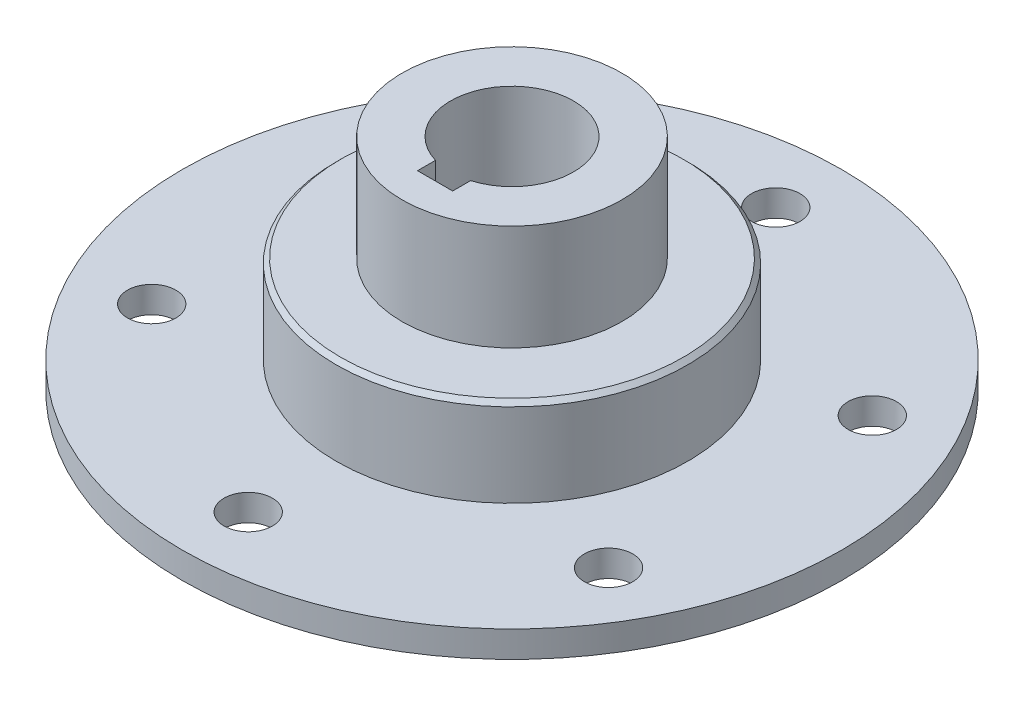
ISO-10303-21;
HEADER;
FILE_DESCRIPTION(('STEP AP214'),'2;1');
FILE_NAME('part.step','',(''),(''),'','','');
FILE_SCHEMA(('AUTOMOTIVE_DESIGN { 1 0 10303 214 1 1 1 1 }'));
ENDSEC;
DATA;
#1=APPLICATION_CONTEXT('core data for automotive mechanical design processes');
#2=APPLICATION_PROTOCOL_DEFINITION('international standard','automotive_design',2000,#1);
#3=PRODUCT_CONTEXT('',#1,'mechanical');
#4=PRODUCT('Part','Part','',(#3));
#5=PRODUCT_RELATED_PRODUCT_CATEGORY('part','',(#4));
#6=PRODUCT_DEFINITION_FORMATION('','',#4);
#7=PRODUCT_DEFINITION_CONTEXT('part definition',#1,'design');
#8=PRODUCT_DEFINITION('design','',#6,#7);
#9=PRODUCT_DEFINITION_SHAPE('','',#8);
#10=(LENGTH_UNIT() NAMED_UNIT(*) SI_UNIT(.MILLI.,.METRE.));
#11=(NAMED_UNIT(*) PLANE_ANGLE_UNIT() SI_UNIT($,.RADIAN.));
#12=(NAMED_UNIT(*) SI_UNIT($,.STERADIAN.) SOLID_ANGLE_UNIT());
#13=UNCERTAINTY_MEASURE_WITH_UNIT(LENGTH_MEASURE(1.E-05),#10,'distance_accuracy_value','');
#14=(GEOMETRIC_REPRESENTATION_CONTEXT(3) GLOBAL_UNCERTAINTY_ASSIGNED_CONTEXT((#13)) GLOBAL_UNIT_ASSIGNED_CONTEXT((#10,
#11,#12)) REPRESENTATION_CONTEXT('',''));
#15=CARTESIAN_POINT('',(0.,0.,0.));
#16=DIRECTION('',(0.,0.,1.));
#17=DIRECTION('',(1.,0.,0.));
#18=AXIS2_PLACEMENT_3D('',#15,#16,#17);
#19=CARTESIAN_POINT('',(0.,30.,0.));
#20=DIRECTION('',(0.,1.,0.));
#21=DIRECTION('',(0.,0.,1.));
#22=AXIS2_PLACEMENT_3D('',#19,#20,#21);
#23=CYLINDRICAL_SURFACE('',#22,40.);
#24=CARTESIAN_POINT('',(0.,4.99999999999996,0.));
#25=DIRECTION('',(0.,1.,0.));
#26=DIRECTION('',(0.,0.,1.));
#27=AXIS2_PLACEMENT_3D('',#24,#25,#26);
#28=CIRCLE('',#27,40.);
#29=CARTESIAN_POINT('',(0.,4.99999999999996,40.));
#30=VERTEX_POINT('',#29);
#31=EDGE_CURVE('E11',#30,#30,#28,.F.);
#32=ORIENTED_EDGE('',*,*,#31,.T.);
#33=EDGE_LOOP('',(#32));
#34=FACE_BOUND('',#33,.T.);
#35=CARTESIAN_POINT('',(0.,-14.,0.));
#36=DIRECTION('',(0.,1.,0.));
#37=DIRECTION('',(0.,0.,1.));
#38=AXIS2_PLACEMENT_3D('',#35,#36,#37);
#39=CIRCLE('',#38,40.);
#40=CARTESIAN_POINT('',(0.,-14.,40.));
#41=VERTEX_POINT('',#40);
#42=EDGE_CURVE('E108',#41,#41,#39,.T.);
#43=ORIENTED_EDGE('',*,*,#42,.T.);
#44=EDGE_LOOP('',(#43));
#45=FACE_BOUND('',#44,.T.);
#46=ADVANCED_FACE('F31',(#34,#45),#23,.T.);
#47=CARTESIAN_POINT('',(-40.,6.,0.));
#48=DIRECTION('',(0.,1.,0.));
#49=DIRECTION('',(0.,0.,1.));
#50=AXIS2_PLACEMENT_3D('',#47,#48,#49);
#51=PLANE('',#50);
#52=CARTESIAN_POINT('',(0.,6.,0.));
#53=DIRECTION('',(0.,1.,0.));
#54=DIRECTION('',(0.,0.,1.));
#55=AXIS2_PLACEMENT_3D('',#52,#53,#54);
#56=CIRCLE('',#55,39.);
#57=CARTESIAN_POINT('',(0.,6.,39.));
#58=VERTEX_POINT('',#57);
#59=EDGE_CURVE('E39',#58,#58,#56,.T.);
#60=ORIENTED_EDGE('',*,*,#59,.T.);
#61=EDGE_LOOP('',(#60));
#62=FACE_BOUND('',#61,.T.);
#63=CARTESIAN_POINT('',(0.,6.,0.));
#64=DIRECTION('',(0.,1.,0.));
#65=DIRECTION('',(0.,0.,1.));
#66=AXIS2_PLACEMENT_3D('',#63,#64,#65);
#67=CIRCLE('',#66,25.);
#68=CARTESIAN_POINT('',(0.,6.,25.));
#69=VERTEX_POINT('',#68);
#70=EDGE_CURVE('E129',#69,#69,#67,.T.);
#71=ORIENTED_EDGE('',*,*,#70,.F.);
#72=EDGE_LOOP('',(#71));
#73=FACE_BOUND('',#72,.T.);
#74=ADVANCED_FACE('F134',(#62,#73),#51,.T.);
#75=CARTESIAN_POINT('',(0.,30.,0.));
#76=DIRECTION('',(0.,1.,0.));
#77=DIRECTION('',(0.,0.,1.));
#78=AXIS2_PLACEMENT_3D('',#75,#76,#77);
#79=CYLINDRICAL_SURFACE('',#78,25.);
#80=ORIENTED_EDGE('',*,*,#70,.T.);
#81=EDGE_LOOP('',(#80));
#82=FACE_BOUND('',#81,.T.);
#83=CARTESIAN_POINT('',(0.,30.,0.));
#84=DIRECTION('',(0.,1.,0.));
#85=DIRECTION('',(0.,0.,1.));
#86=AXIS2_PLACEMENT_3D('',#83,#84,#85);
#87=CIRCLE('',#86,25.);
#88=CARTESIAN_POINT('',(0.,30.,25.));
#89=VERTEX_POINT('',#88);
#90=EDGE_CURVE('E126',#89,#89,#87,.T.);
#91=ORIENTED_EDGE('',*,*,#90,.F.);
#92=EDGE_LOOP('',(#91));
#93=FACE_BOUND('',#92,.T.);
#94=ADVANCED_FACE('F155',(#82,#93),#79,.T.);
#95=CARTESIAN_POINT('',(-25.,30.,0.));
#96=DIRECTION('',(0.,1.,0.));
#97=DIRECTION('',(0.,0.,1.));
#98=AXIS2_PLACEMENT_3D('',#95,#96,#97);
#99=PLANE('',#98);
#100=CARTESIAN_POINT('',(0.,30.,0.));
#101=DIRECTION('',(0.,-1.,0.));
#102=DIRECTION('',(0.,0.,-1.));
#103=AXIS2_PLACEMENT_3D('',#100,#101,#102);
#104=CIRCLE('',#103,14.);
#105=CARTESIAN_POINT('',(-4.,30.,13.4164078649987));
#106=VERTEX_POINT('',#105);
#107=CARTESIAN_POINT('',(4.,30.,13.4164078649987));
#108=VERTEX_POINT('',#107);
#109=EDGE_CURVE('E74',#106,#108,#104,.T.);
#110=ORIENTED_EDGE('',*,*,#109,.T.);
#111=DIRECTION('',(0.,0.,1.));
#112=VECTOR('',#111,1.);
#113=CARTESIAN_POINT('',(4.,30.,17.5));
#114=LINE('',#113,#112);
#115=CARTESIAN_POINT('',(4.,30.,17.5));
#116=VERTEX_POINT('',#115);
#117=EDGE_CURVE('E83',#108,#116,#114,.T.);
#118=ORIENTED_EDGE('',*,*,#117,.T.);
#119=DIRECTION('',(-1.,0.,0.));
#120=VECTOR('',#119,1.);
#121=CARTESIAN_POINT('',(-4.,30.,17.5));
#122=LINE('',#121,#120);
#123=CARTESIAN_POINT('',(-4.,30.,17.5));
#124=VERTEX_POINT('',#123);
#125=EDGE_CURVE('E46',#116,#124,#122,.T.);
#126=ORIENTED_EDGE('',*,*,#125,.T.);
#127=DIRECTION('',(0.,0.,-1.));
#128=VECTOR('',#127,1.);
#129=CARTESIAN_POINT('',(-4.,30.,13.4164078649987));
#130=LINE('',#129,#128);
#131=EDGE_CURVE('E80',#124,#106,#130,.T.);
#132=ORIENTED_EDGE('',*,*,#131,.T.);
#133=EDGE_LOOP('',(#110,#118,#126,#132));
#134=FACE_BOUND('',#133,.T.);
#135=ORIENTED_EDGE('',*,*,#90,.T.);
#136=EDGE_LOOP('',(#135));
#137=FACE_BOUND('',#136,.T.);
#138=ADVANCED_FACE('F87',(#134,#137),#99,.T.);
#139=CARTESIAN_POINT('',(0.,-30.,0.));
#140=DIRECTION('',(0.,-1.,0.));
#141=DIRECTION('',(0.,0.,-1.));
#142=AXIS2_PLACEMENT_3D('',#139,#140,#141);
#143=PLANE('',#142);
#144=CARTESIAN_POINT('',(0.,-30.,0.));
#145=DIRECTION('',(0.,-1.,0.));
#146=DIRECTION('',(0.,0.,-1.));
#147=AXIS2_PLACEMENT_3D('',#144,#145,#146);
#148=CIRCLE('',#147,14.);
#149=CARTESIAN_POINT('',(-4.,-30.,13.4164078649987));
#150=VERTEX_POINT('',#149);
#151=CARTESIAN_POINT('',(4.,-30.,13.4164078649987));
#152=VERTEX_POINT('',#151);
#153=EDGE_CURVE('E54',#150,#152,#148,.T.);
#154=ORIENTED_EDGE('',*,*,#153,.F.);
#155=DIRECTION('',(0.,0.,-1.));
#156=VECTOR('',#155,1.);
#157=CARTESIAN_POINT('',(-4.,-30.,13.4164078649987));
#158=LINE('',#157,#156);
#159=CARTESIAN_POINT('',(-4.,-30.,17.5));
#160=VERTEX_POINT('',#159);
#161=EDGE_CURVE('E90',#160,#150,#158,.T.);
#162=ORIENTED_EDGE('',*,*,#161,.F.);
#163=DIRECTION('',(-1.,0.,0.));
#164=VECTOR('',#163,1.);
#165=CARTESIAN_POINT('',(-4.,-30.,17.5));
#166=LINE('',#165,#164);
#167=CARTESIAN_POINT('',(4.,-30.,17.5));
#168=VERTEX_POINT('',#167);
#169=EDGE_CURVE('E93',#168,#160,#166,.T.);
#170=ORIENTED_EDGE('',*,*,#169,.F.);
#171=DIRECTION('',(0.,0.,1.));
#172=VECTOR('',#171,1.);
#173=CARTESIAN_POINT('',(4.,-30.,17.5));
#174=LINE('',#173,#172);
#175=EDGE_CURVE('E102',#152,#168,#174,.T.);
#176=ORIENTED_EDGE('',*,*,#175,.F.);
#177=EDGE_LOOP('',(#154,#162,#170,#176));
#178=FACE_BOUND('',#177,.T.);
#179=CARTESIAN_POINT('',(0.,-30.,0.));
#180=DIRECTION('',(0.,1.,0.));
#181=DIRECTION('',(0.,0.,1.));
#182=AXIS2_PLACEMENT_3D('',#179,#180,#181);
#183=CIRCLE('',#182,25.);
#184=CARTESIAN_POINT('',(0.,-30.,25.));
#185=VERTEX_POINT('',#184);
#186=EDGE_CURVE('E123',#185,#185,#183,.T.);
#187=ORIENTED_EDGE('',*,*,#186,.F.);
#188=EDGE_LOOP('',(#187));
#189=FACE_BOUND('',#188,.T.);
#190=ADVANCED_FACE('F164',(#178,#189),#143,.T.);
#191=CARTESIAN_POINT('',(0.,30.,0.));
#192=DIRECTION('',(0.,1.,0.));
#193=DIRECTION('',(0.,0.,1.));
#194=AXIS2_PLACEMENT_3D('',#191,#192,#193);
#195=CYLINDRICAL_SURFACE('',#194,25.);
#196=ORIENTED_EDGE('',*,*,#186,.T.);
#197=EDGE_LOOP('',(#196));
#198=FACE_BOUND('',#197,.T.);
#199=CARTESIAN_POINT('',(0.,-20.,0.));
#200=DIRECTION('',(0.,1.,0.));
#201=DIRECTION('',(0.,0.,1.));
#202=AXIS2_PLACEMENT_3D('',#199,#200,#201);
#203=CIRCLE('',#202,25.);
#204=CARTESIAN_POINT('',(0.,-20.,25.));
#205=VERTEX_POINT('',#204);
#206=EDGE_CURVE('E120',#205,#205,#203,.T.);
#207=ORIENTED_EDGE('',*,*,#206,.F.);
#208=EDGE_LOOP('',(#207));
#209=FACE_BOUND('',#208,.T.);
#210=ADVANCED_FACE('F167',(#198,#209),#195,.T.);
#211=CARTESIAN_POINT('',(-25.,-20.,0.));
#212=DIRECTION('',(0.,-1.,0.));
#213=DIRECTION('',(0.,0.,-1.));
#214=AXIS2_PLACEMENT_3D('',#211,#212,#213);
#215=PLANE('',#214);
#216=CARTESIAN_POINT('',(-51.961524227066,-20.,30.0000000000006));
#217=DIRECTION('',(0.,-1.,0.));
#218=DIRECTION('',(0.,0.,-1.));
#219=AXIS2_PLACEMENT_3D('',#216,#217,#218);
#220=CIRCLE('',#219,5.50000000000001);
#221=CARTESIAN_POINT('',(-51.961524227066,-20.,24.5000000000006));
#222=VERTEX_POINT('',#221);
#223=EDGE_CURVE('E215',#222,#222,#220,.T.);
#224=ORIENTED_EDGE('',*,*,#223,.F.);
#225=EDGE_LOOP('',(#224));
#226=FACE_BOUND('',#225,.T.);
#227=CARTESIAN_POINT('',(-51.9615242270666,-20.,-29.9999999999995));
#228=DIRECTION('',(0.,-1.,0.));
#229=DIRECTION('',(0.,0.,-1.));
#230=AXIS2_PLACEMENT_3D('',#227,#228,#229);
#231=CIRCLE('',#230,5.50000000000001);
#232=CARTESIAN_POINT('',(-51.9615242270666,-20.,-35.4999999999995));
#233=VERTEX_POINT('',#232);
#234=EDGE_CURVE('E225',#233,#233,#231,.T.);
#235=ORIENTED_EDGE('',*,*,#234,.F.);
#236=EDGE_LOOP('',(#235));
#237=FACE_BOUND('',#236,.T.);
#238=CARTESIAN_POINT('',(-4.18978003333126E-13,-20.,-60.));
#239=DIRECTION('',(0.,-1.,0.));
#240=DIRECTION('',(0.,0.,-1.));
#241=AXIS2_PLACEMENT_3D('',#238,#239,#240);
#242=CIRCLE('',#241,5.50000000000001);
#243=CARTESIAN_POINT('',(-4.18978003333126E-13,-20.,-65.5));
#244=VERTEX_POINT('',#243);
#245=EDGE_CURVE('E231',#244,#244,#242,.T.);
#246=ORIENTED_EDGE('',*,*,#245,.F.);
#247=EDGE_LOOP('',(#246));
#248=FACE_BOUND('',#247,.T.);
#249=CARTESIAN_POINT('',(51.9615242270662,-20.,-30.0000000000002));
#250=DIRECTION('',(0.,-1.,0.));
#251=DIRECTION('',(0.,0.,-1.));
#252=AXIS2_PLACEMENT_3D('',#249,#250,#251);
#253=CIRCLE('',#252,5.50000000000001);
#254=CARTESIAN_POINT('',(51.9615242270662,-20.,-35.5000000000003));
#255=VERTEX_POINT('',#254);
#256=EDGE_CURVE('E237',#255,#255,#253,.T.);
#257=ORIENTED_EDGE('',*,*,#256,.F.);
#258=EDGE_LOOP('',(#257));
#259=FACE_BOUND('',#258,.T.);
#260=CARTESIAN_POINT('',(51.9615242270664,-20.,29.9999999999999));
#261=DIRECTION('',(0.,-1.,0.));
#262=DIRECTION('',(0.,0.,-1.));
#263=AXIS2_PLACEMENT_3D('',#260,#261,#262);
#264=CIRCLE('',#263,5.50000000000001);
#265=CARTESIAN_POINT('',(51.9615242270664,-20.,24.4999999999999));
#266=VERTEX_POINT('',#265);
#267=EDGE_CURVE('E243',#266,#266,#264,.T.);
#268=ORIENTED_EDGE('',*,*,#267,.F.);
#269=EDGE_LOOP('',(#268));
#270=FACE_BOUND('',#269,.T.);
#271=CARTESIAN_POINT('',(0.,-20.,60.));
#272=DIRECTION('',(0.,-1.,0.));
#273=DIRECTION('',(0.,0.,-1.));
#274=AXIS2_PLACEMENT_3D('',#271,#272,#273);
#275=CIRCLE('',#274,5.50000000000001);
#276=CARTESIAN_POINT('',(0.,-20.,54.5));
#277=VERTEX_POINT('',#276);
#278=EDGE_CURVE('E96',#277,#277,#275,.T.);
#279=ORIENTED_EDGE('',*,*,#278,.F.);
#280=EDGE_LOOP('',(#279));
#281=FACE_BOUND('',#280,.T.);
#282=ORIENTED_EDGE('',*,*,#206,.T.);
#283=EDGE_LOOP('',(#282));
#284=FACE_BOUND('',#283,.T.);
#285=CARTESIAN_POINT('',(0.,-20.,0.));
#286=DIRECTION('',(0.,1.,0.));
#287=DIRECTION('',(0.,0.,1.));
#288=AXIS2_PLACEMENT_3D('',#285,#286,#287);
#289=CIRCLE('',#288,75.);
#290=CARTESIAN_POINT('',(0.,-20.,75.));
#291=VERTEX_POINT('',#290);
#292=EDGE_CURVE('E117',#291,#291,#289,.T.);
#293=ORIENTED_EDGE('',*,*,#292,.F.);
#294=EDGE_LOOP('',(#293));
#295=FACE_BOUND('',#294,.T.);
#296=ADVANCED_FACE('F171',(#226,#237,#248,#259,#270,#281,#284,#295),#215,.T.);
#297=CARTESIAN_POINT('',(0.,30.,0.));
#298=DIRECTION('',(0.,1.,0.));
#299=DIRECTION('',(0.,0.,1.));
#300=AXIS2_PLACEMENT_3D('',#297,#298,#299);
#301=CYLINDRICAL_SURFACE('',#300,75.);
#302=ORIENTED_EDGE('',*,*,#292,.T.);
#303=EDGE_LOOP('',(#302));
#304=FACE_BOUND('',#303,.T.);
#305=CARTESIAN_POINT('',(0.,-14.,0.));
#306=DIRECTION('',(0.,1.,0.));
#307=DIRECTION('',(0.,0.,1.));
#308=AXIS2_PLACEMENT_3D('',#305,#306,#307);
#309=CIRCLE('',#308,75.);
#310=CARTESIAN_POINT('',(0.,-14.,75.));
#311=VERTEX_POINT('',#310);
#312=EDGE_CURVE('E114',#311,#311,#309,.T.);
#313=ORIENTED_EDGE('',*,*,#312,.F.);
#314=EDGE_LOOP('',(#313));
#315=FACE_BOUND('',#314,.T.);
#316=ADVANCED_FACE('F175',(#304,#315),#301,.T.);
#317=CARTESIAN_POINT('',(-75.,-14.,0.));
#318=DIRECTION('',(0.,1.,0.));
#319=DIRECTION('',(0.,0.,1.));
#320=AXIS2_PLACEMENT_3D('',#317,#318,#319);
#321=PLANE('',#320);
#322=CARTESIAN_POINT('',(-51.961524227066,-14.,30.0000000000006));
#323=DIRECTION('',(0.,1.,0.));
#324=DIRECTION('',(0.,0.,1.));
#325=AXIS2_PLACEMENT_3D('',#322,#323,#324);
#326=CIRCLE('',#325,5.50000000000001);
#327=CARTESIAN_POINT('',(-51.961524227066,-14.,35.5000000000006));
#328=VERTEX_POINT('',#327);
#329=EDGE_CURVE('E218',#328,#328,#326,.T.);
#330=ORIENTED_EDGE('',*,*,#329,.F.);
#331=EDGE_LOOP('',(#330));
#332=FACE_BOUND('',#331,.T.);
#333=CARTESIAN_POINT('',(-51.9615242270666,-14.,-29.9999999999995));
#334=DIRECTION('',(0.,1.,0.));
#335=DIRECTION('',(0.,0.,1.));
#336=AXIS2_PLACEMENT_3D('',#333,#334,#335);
#337=CIRCLE('',#336,5.50000000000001);
#338=CARTESIAN_POINT('',(-51.9615242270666,-14.,-24.4999999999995));
#339=VERTEX_POINT('',#338);
#340=EDGE_CURVE('E220',#339,#339,#337,.T.);
#341=ORIENTED_EDGE('',*,*,#340,.F.);
#342=EDGE_LOOP('',(#341));
#343=FACE_BOUND('',#342,.T.);
#344=CARTESIAN_POINT('',(-4.18978003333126E-13,-14.,-60.));
#345=DIRECTION('',(0.,1.,0.));
#346=DIRECTION('',(0.,0.,1.));
#347=AXIS2_PLACEMENT_3D('',#344,#345,#346);
#348=CIRCLE('',#347,5.50000000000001);
#349=CARTESIAN_POINT('',(-4.18978003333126E-13,-14.,-54.5));
#350=VERTEX_POINT('',#349);
#351=EDGE_CURVE('E228',#350,#350,#348,.T.);
#352=ORIENTED_EDGE('',*,*,#351,.F.);
#353=EDGE_LOOP('',(#352));
#354=FACE_BOUND('',#353,.T.);
#355=CARTESIAN_POINT('',(51.9615242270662,-14.,-30.0000000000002));
#356=DIRECTION('',(0.,1.,0.));
#357=DIRECTION('',(0.,0.,1.));
#358=AXIS2_PLACEMENT_3D('',#355,#356,#357);
#359=CIRCLE('',#358,5.50000000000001);
#360=CARTESIAN_POINT('',(51.9615242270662,-14.,-24.5000000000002));
#361=VERTEX_POINT('',#360);
#362=EDGE_CURVE('E234',#361,#361,#359,.T.);
#363=ORIENTED_EDGE('',*,*,#362,.F.);
#364=EDGE_LOOP('',(#363));
#365=FACE_BOUND('',#364,.T.);
#366=CARTESIAN_POINT('',(51.9615242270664,-14.,29.9999999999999));
#367=DIRECTION('',(0.,1.,0.));
#368=DIRECTION('',(0.,0.,1.));
#369=AXIS2_PLACEMENT_3D('',#366,#367,#368);
#370=CIRCLE('',#369,5.50000000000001);
#371=CARTESIAN_POINT('',(51.9615242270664,-14.,35.4999999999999));
#372=VERTEX_POINT('',#371);
#373=EDGE_CURVE('E240',#372,#372,#370,.T.);
#374=ORIENTED_EDGE('',*,*,#373,.F.);
#375=EDGE_LOOP('',(#374));
#376=FACE_BOUND('',#375,.T.);
#377=CARTESIAN_POINT('',(0.,-14.,60.));
#378=DIRECTION('',(0.,1.,0.));
#379=DIRECTION('',(0.,0.,1.));
#380=AXIS2_PLACEMENT_3D('',#377,#378,#379);
#381=CIRCLE('',#380,5.50000000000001);
#382=CARTESIAN_POINT('',(0.,-14.,65.5));
#383=VERTEX_POINT('',#382);
#384=EDGE_CURVE('E245',#383,#383,#381,.T.);
#385=ORIENTED_EDGE('',*,*,#384,.F.);
#386=EDGE_LOOP('',(#385));
#387=FACE_BOUND('',#386,.T.);
#388=ORIENTED_EDGE('',*,*,#312,.T.);
#389=EDGE_LOOP('',(#388));
#390=FACE_BOUND('',#389,.T.);
#391=ORIENTED_EDGE('',*,*,#42,.F.);
#392=EDGE_LOOP('',(#391));
#393=FACE_BOUND('',#392,.T.);
#394=ADVANCED_FACE('F179',(#332,#343,#354,#365,#376,#387,#390,#393),#321,.T.);
#395=CARTESIAN_POINT('',(0.,30.,0.));
#396=DIRECTION('',(0.,-1.,0.));
#397=DIRECTION('',(0.,0.,-1.));
#398=AXIS2_PLACEMENT_3D('',#395,#396,#397);
#399=CYLINDRICAL_SURFACE('',#398,14.);
#400=ORIENTED_EDGE('',*,*,#153,.T.);
#401=DIRECTION('',(0.,-1.,0.));
#402=VECTOR('',#401,1.);
#403=CARTESIAN_POINT('',(4.,30.,13.4164078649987));
#404=LINE('',#403,#402);
#405=EDGE_CURVE('E70',#108,#152,#404,.T.);
#406=ORIENTED_EDGE('',*,*,#405,.F.);
#407=ORIENTED_EDGE('',*,*,#109,.F.);
#408=DIRECTION('',(0.,-1.,0.));
#409=VECTOR('',#408,1.);
#410=CARTESIAN_POINT('',(-4.,30.,13.4164078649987));
#411=LINE('',#410,#409);
#412=EDGE_CURVE('E106',#106,#150,#411,.T.);
#413=ORIENTED_EDGE('',*,*,#412,.T.);
#414=EDGE_LOOP('',(#400,#406,#407,#413));
#415=FACE_BOUND('',#414,.T.);
#416=ADVANCED_FACE('F72',(#415),#399,.F.);
#417=CARTESIAN_POINT('',(-4.,30.,13.4164078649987));
#418=DIRECTION('',(-1.,0.,0.));
#419=DIRECTION('',(0.,0.,1.));
#420=AXIS2_PLACEMENT_3D('',#417,#418,#419);
#421=PLANE('',#420);
#422=ORIENTED_EDGE('',*,*,#161,.T.);
#423=ORIENTED_EDGE('',*,*,#412,.F.);
#424=ORIENTED_EDGE('',*,*,#131,.F.);
#425=DIRECTION('',(0.,-1.,0.));
#426=VECTOR('',#425,1.);
#427=CARTESIAN_POINT('',(-4.,30.,17.5));
#428=LINE('',#427,#426);
#429=EDGE_CURVE('E109',#124,#160,#428,.T.);
#430=ORIENTED_EDGE('',*,*,#429,.T.);
#431=EDGE_LOOP('',(#422,#423,#424,#430));
#432=FACE_BOUND('',#431,.T.);
#433=ADVANCED_FACE('F185',(#432),#421,.F.);
#434=CARTESIAN_POINT('',(-4.,30.,17.5));
#435=DIRECTION('',(0.,0.,1.));
#436=DIRECTION('',(1.,0.,0.));
#437=AXIS2_PLACEMENT_3D('',#434,#435,#436);
#438=PLANE('',#437);
#439=ORIENTED_EDGE('',*,*,#169,.T.);
#440=ORIENTED_EDGE('',*,*,#429,.F.);
#441=ORIENTED_EDGE('',*,*,#125,.F.);
#442=DIRECTION('',(0.,-1.,0.));
#443=VECTOR('',#442,1.);
#444=CARTESIAN_POINT('',(4.,30.,17.5));
#445=LINE('',#444,#443);
#446=EDGE_CURVE('E79',#116,#168,#445,.T.);
#447=ORIENTED_EDGE('',*,*,#446,.T.);
#448=EDGE_LOOP('',(#439,#440,#441,#447));
#449=FACE_BOUND('',#448,.T.);
#450=ADVANCED_FACE('F147',(#449),#438,.F.);
#451=CARTESIAN_POINT('',(4.,30.,17.5));
#452=DIRECTION('',(1.,0.,0.));
#453=DIRECTION('',(0.,0.,-1.));
#454=AXIS2_PLACEMENT_3D('',#451,#452,#453);
#455=PLANE('',#454);
#456=ORIENTED_EDGE('',*,*,#175,.T.);
#457=ORIENTED_EDGE('',*,*,#446,.F.);
#458=ORIENTED_EDGE('',*,*,#117,.F.);
#459=ORIENTED_EDGE('',*,*,#405,.T.);
#460=EDGE_LOOP('',(#456,#457,#458,#459));
#461=FACE_BOUND('',#460,.T.);
#462=ADVANCED_FACE('F84',(#461),#455,.F.);
#463=CARTESIAN_POINT('',(0.,6.,0.));
#464=DIRECTION('',(0.,-1.,0.));
#465=DIRECTION('',(0.,0.,-1.));
#466=AXIS2_PLACEMENT_3D('',#463,#464,#465);
#467=CONICAL_SURFACE('',#466,39.,0.785398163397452);
#468=ORIENTED_EDGE('',*,*,#31,.F.);
#469=EDGE_LOOP('',(#468));
#470=FACE_BOUND('',#469,.T.);
#471=ORIENTED_EDGE('',*,*,#59,.F.);
#472=EDGE_LOOP('',(#471));
#473=FACE_BOUND('',#472,.T.);
#474=ADVANCED_FACE('F33',(#470,#473),#467,.T.);
#475=CARTESIAN_POINT('',(0.,-14.,60.));
#476=DIRECTION('',(0.,1.,0.));
#477=DIRECTION('',(0.,0.,1.));
#478=AXIS2_PLACEMENT_3D('',#475,#476,#477);
#479=CYLINDRICAL_SURFACE('',#478,5.50000000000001);
#480=ORIENTED_EDGE('',*,*,#278,.T.);
#481=EDGE_LOOP('',(#480));
#482=FACE_BOUND('',#481,.T.);
#483=ORIENTED_EDGE('',*,*,#384,.T.);
#484=EDGE_LOOP('',(#483));
#485=FACE_BOUND('',#484,.T.);
#486=ADVANCED_FACE('F138',(#482,#485),#479,.F.);
#487=CARTESIAN_POINT('',(51.9615242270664,-14.,29.9999999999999));
#488=DIRECTION('',(0.,1.,0.));
#489=DIRECTION('',(0.,0.,1.));
#490=AXIS2_PLACEMENT_3D('',#487,#488,#489);
#491=CYLINDRICAL_SURFACE('',#490,5.50000000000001);
#492=ORIENTED_EDGE('',*,*,#267,.T.);
#493=EDGE_LOOP('',(#492));
#494=FACE_BOUND('',#493,.T.);
#495=ORIENTED_EDGE('',*,*,#373,.T.);
#496=EDGE_LOOP('',(#495));
#497=FACE_BOUND('',#496,.T.);
#498=ADVANCED_FACE('F144',(#494,#497),#491,.F.);
#499=CARTESIAN_POINT('',(51.9615242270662,-14.,-30.0000000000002));
#500=DIRECTION('',(0.,1.,0.));
#501=DIRECTION('',(0.,0.,1.));
#502=AXIS2_PLACEMENT_3D('',#499,#500,#501);
#503=CYLINDRICAL_SURFACE('',#502,5.50000000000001);
#504=ORIENTED_EDGE('',*,*,#256,.T.);
#505=EDGE_LOOP('',(#504));
#506=FACE_BOUND('',#505,.T.);
#507=ORIENTED_EDGE('',*,*,#362,.T.);
#508=EDGE_LOOP('',(#507));
#509=FACE_BOUND('',#508,.T.);
#510=ADVANCED_FACE('F194',(#506,#509),#503,.F.);
#511=CARTESIAN_POINT('',(-4.18978003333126E-13,-14.,-60.));
#512=DIRECTION('',(0.,1.,0.));
#513=DIRECTION('',(0.,0.,1.));
#514=AXIS2_PLACEMENT_3D('',#511,#512,#513);
#515=CYLINDRICAL_SURFACE('',#514,5.50000000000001);
#516=ORIENTED_EDGE('',*,*,#245,.T.);
#517=EDGE_LOOP('',(#516));
#518=FACE_BOUND('',#517,.T.);
#519=ORIENTED_EDGE('',*,*,#351,.T.);
#520=EDGE_LOOP('',(#519));
#521=FACE_BOUND('',#520,.T.);
#522=ADVANCED_FACE('F198',(#518,#521),#515,.F.);
#523=CARTESIAN_POINT('',(-51.9615242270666,-14.,-29.9999999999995));
#524=DIRECTION('',(0.,1.,0.));
#525=DIRECTION('',(0.,0.,1.));
#526=AXIS2_PLACEMENT_3D('',#523,#524,#525);
#527=CYLINDRICAL_SURFACE('',#526,5.50000000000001);
#528=ORIENTED_EDGE('',*,*,#234,.T.);
#529=EDGE_LOOP('',(#528));
#530=FACE_BOUND('',#529,.T.);
#531=ORIENTED_EDGE('',*,*,#340,.T.);
#532=EDGE_LOOP('',(#531));
#533=FACE_BOUND('',#532,.T.);
#534=ADVANCED_FACE('F202',(#530,#533),#527,.F.);
#535=CARTESIAN_POINT('',(-51.961524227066,-14.,30.0000000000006));
#536=DIRECTION('',(0.,1.,0.));
#537=DIRECTION('',(0.,0.,1.));
#538=AXIS2_PLACEMENT_3D('',#535,#536,#537);
#539=CYLINDRICAL_SURFACE('',#538,5.50000000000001);
#540=ORIENTED_EDGE('',*,*,#223,.T.);
#541=EDGE_LOOP('',(#540));
#542=FACE_BOUND('',#541,.T.);
#543=ORIENTED_EDGE('',*,*,#329,.T.);
#544=EDGE_LOOP('',(#543));
#545=FACE_BOUND('',#544,.T.);
#546=ADVANCED_FACE('F206',(#542,#545),#539,.F.);
#547=CLOSED_SHELL('',(#46,#74,#94,#138,#190,#210,#296,#316,#394,#416,#433,#450,#462,#474,#486,
#498,#510,#522,#534,#546));
#548=MANIFOLD_SOLID_BREP('B2',#547);
#549=ADVANCED_BREP_SHAPE_REPRESENTATION('',(#18,#548),#14);
#550=SHAPE_DEFINITION_REPRESENTATION(#9,#549);
ENDSEC;
END-ISO-10303-21;
